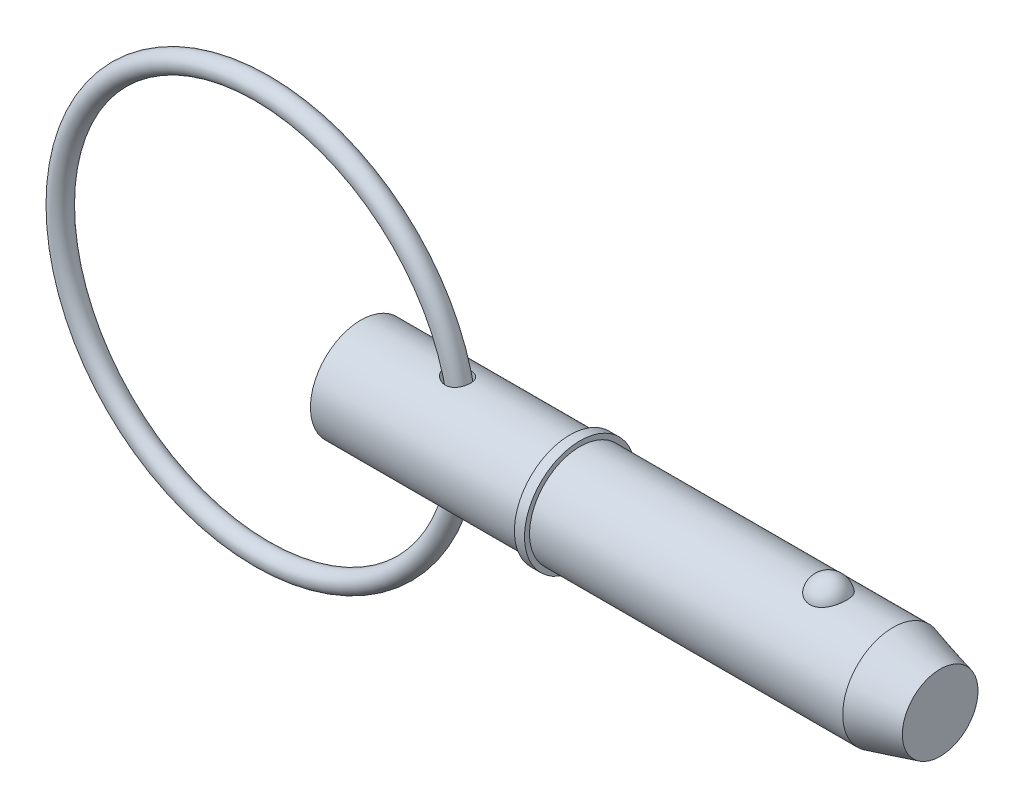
ISO-10303-21;
HEADER;
FILE_DESCRIPTION(('STEP AP214'),'2;1');
FILE_NAME('part.step','',(''),(''),'','','');
FILE_SCHEMA(('AUTOMOTIVE_DESIGN { 1 0 10303 214 1 1 1 1 }'));
ENDSEC;
DATA;
#1=APPLICATION_CONTEXT('core data for automotive mechanical design processes');
#2=APPLICATION_PROTOCOL_DEFINITION('international standard','automotive_design',2000,#1);
#3=PRODUCT_CONTEXT('',#1,'mechanical');
#4=PRODUCT('Part','Part','',(#3));
#5=PRODUCT_RELATED_PRODUCT_CATEGORY('part','',(#4));
#6=PRODUCT_DEFINITION_FORMATION('','',#4);
#7=PRODUCT_DEFINITION_CONTEXT('part definition',#1,'design');
#8=PRODUCT_DEFINITION('design','',#6,#7);
#9=PRODUCT_DEFINITION_SHAPE('','',#8);
#10=(LENGTH_UNIT() NAMED_UNIT(*) SI_UNIT(.MILLI.,.METRE.));
#11=(NAMED_UNIT(*) PLANE_ANGLE_UNIT() SI_UNIT($,.RADIAN.));
#12=(NAMED_UNIT(*) SI_UNIT($,.STERADIAN.) SOLID_ANGLE_UNIT());
#13=UNCERTAINTY_MEASURE_WITH_UNIT(LENGTH_MEASURE(1.E-05),#10,'distance_accuracy_value','');
#14=(GEOMETRIC_REPRESENTATION_CONTEXT(3) GLOBAL_UNCERTAINTY_ASSIGNED_CONTEXT((#13)) GLOBAL_UNIT_ASSIGNED_CONTEXT((#10,
#11,#12)) REPRESENTATION_CONTEXT('',''));
#15=CARTESIAN_POINT('',(0.,0.,0.));
#16=DIRECTION('',(0.,0.,1.));
#17=DIRECTION('',(1.,0.,0.));
#18=AXIS2_PLACEMENT_3D('',#15,#16,#17);
#19=CARTESIAN_POINT('',(-10.8860601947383,0.,0.));
#20=DIRECTION('',(0.,0.,1.));
#21=DIRECTION('',(1.,0.,0.));
#22=AXIS2_PLACEMENT_3D('',#19,#20,#21);
#23=TOROIDAL_SURFACE('',#22,22.225,1.111);
#24=CARTESIAN_POINT('',(12.4499398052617,0.,0.));
#25=VERTEX_POINT('',#24);
#26=VERTEX_LOOP('',#25);
#27=FACE_BOUND('',#26,.T.);
#28=ADVANCED_FACE('P0_F12',(#27),#23,.T.);
#29=CLOSED_SHELL('',(#28));
#30=MANIFOLD_SOLID_BREP('P0_B1',#29);
#31=CARTESIAN_POINT('',(0.,0.,0.));
#32=DIRECTION('',(1.,0.,0.));
#33=DIRECTION('',(0.,0.,-1.));
#34=AXIS2_PLACEMENT_3D('',#31,#32,#33);
#35=CYLINDRICAL_SURFACE('',#34,5.555);
#36=CARTESIAN_POINT('',(9.73108588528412,5.4531967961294,-1.05861687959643));
#37=CARTESIAN_POINT('',(9.79852417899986,5.4428857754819,-1.11173367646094));
#38=CARTESIAN_POINT('',(9.8705426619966,5.43287373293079,-1.15917228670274));
#39=CARTESIAN_POINT('',(10.0216706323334,5.41463354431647,-1.24159548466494));
#40=CARTESIAN_POINT('',(10.100788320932,5.40640749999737,-1.27656543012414));
#41=CARTESIAN_POINT('',(10.2640671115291,5.39277501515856,-1.33298568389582));
#42=CARTESIAN_POINT('',(10.3482338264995,5.38737178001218,-1.35442062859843));
#43=CARTESIAN_POINT('',(10.5191189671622,5.38018930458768,-1.38268153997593));
#44=CARTESIAN_POINT('',(10.6058357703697,5.37840780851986,-1.38951660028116));
#45=CARTESIAN_POINT('',(10.7759121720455,5.37883071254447,-1.38787777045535));
#46=CARTESIAN_POINT('',(10.8592768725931,5.38088957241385,-1.37996287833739));
#47=CARTESIAN_POINT('',(11.0231742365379,5.38856355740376,-1.34968531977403));
#48=CARTESIAN_POINT('',(11.1037078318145,5.39417750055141,-1.3273274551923));
#49=CARTESIAN_POINT('',(11.2542656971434,5.40784427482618,-1.27044672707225));
#50=CARTESIAN_POINT('',(11.3246325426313,5.41571997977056,-1.23678468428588));
#51=CARTESIAN_POINT('',(11.4584043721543,5.43310849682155,-1.15800564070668));
#52=CARTESIAN_POINT('',(11.5218100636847,5.4426211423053,-1.11288980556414));
#53=CARTESIAN_POINT('',(11.6387006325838,5.4619946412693,-1.01348173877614));
#54=CARTESIAN_POINT('',(11.6923567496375,5.47184490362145,-0.959388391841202));
#55=CARTESIAN_POINT('',(11.7899079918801,5.49098914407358,-0.842935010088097));
#56=CARTESIAN_POINT('',(11.8338027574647,5.50028310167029,-0.780574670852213));
#57=CARTESIAN_POINT('',(11.9111930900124,5.51740919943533,-0.64860577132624));
#58=CARTESIAN_POINT('',(11.944571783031,5.52522454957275,-0.578926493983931));
#59=CARTESIAN_POINT('',(11.9994972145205,5.53842713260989,-0.434834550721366));
#60=CARTESIAN_POINT('',(12.0210434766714,5.54381426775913,-0.360421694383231));
#61=CARTESIAN_POINT('',(12.0519313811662,5.55161917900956,-0.208311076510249));
#62=CARTESIAN_POINT('',(12.0611710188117,5.55401212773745,-0.130591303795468));
#63=CARTESIAN_POINT('',(12.0668974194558,5.55548938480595,0.0253480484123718));
#64=CARTESIAN_POINT('',(12.0633840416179,5.55457365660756,0.10356763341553));
#65=CARTESIAN_POINT('',(12.0436796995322,5.54953010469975,0.258343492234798));
#66=CARTESIAN_POINT('',(12.0274798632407,5.54540003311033,0.334898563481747));
#67=CARTESIAN_POINT('',(11.9827711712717,5.53437033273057,0.48411831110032));
#68=CARTESIAN_POINT('',(11.9542620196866,5.52747063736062,0.556782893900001));
#69=CARTESIAN_POINT('',(11.8856108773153,5.51165296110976,0.696153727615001));
#70=CARTESIAN_POINT('',(11.8454690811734,5.50273501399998,0.762860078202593));
#71=CARTESIAN_POINT('',(11.7545317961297,5.48386724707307,0.888403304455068));
#72=CARTESIAN_POINT('',(11.7037367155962,5.47391746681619,0.947240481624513));
#73=CARTESIAN_POINT('',(11.5931044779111,5.45416351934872,1.05504470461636));
#74=CARTESIAN_POINT('',(11.533318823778,5.44435885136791,1.10406448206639));
#75=CARTESIAN_POINT('',(11.4061321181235,5.42595363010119,1.19123649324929));
#76=CARTESIAN_POINT('',(11.3387321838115,5.41735290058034,1.22939031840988));
#77=CARTESIAN_POINT('',(11.1991395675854,5.4024225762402,1.29341737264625));
#78=CARTESIAN_POINT('',(11.1270175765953,5.39606585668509,1.3194385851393));
#79=CARTESIAN_POINT('',(10.979323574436,5.38614405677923,1.35937634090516));
#80=CARTESIAN_POINT('',(10.9037515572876,5.38257898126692,1.37329286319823));
#81=CARTESIAN_POINT('',(10.7507722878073,5.37854282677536,1.38901730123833));
#82=CARTESIAN_POINT('',(10.6733560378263,5.37809300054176,1.39074204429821));
#83=CARTESIAN_POINT('',(10.5192388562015,5.38029043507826,1.38221411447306));
#84=CARTESIAN_POINT('',(10.4425381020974,5.38293844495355,1.37195854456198));
#85=CARTESIAN_POINT('',(10.2878936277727,5.39116673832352,1.33926960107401));
#86=CARTESIAN_POINT('',(10.2100819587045,5.3968880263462,1.31624874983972));
#87=CARTESIAN_POINT('',(10.0591420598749,5.41064666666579,1.25849276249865));
#88=CARTESIAN_POINT('',(9.98601576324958,5.41868496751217,1.22375282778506));
#89=CARTESIAN_POINT('',(9.84175565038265,5.43675805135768,1.14087469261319));
#90=CARTESIAN_POINT('',(9.77103801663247,5.44688674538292,1.09202994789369));
#91=CARTESIAN_POINT('',(9.6388828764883,5.46759592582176,0.983100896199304));
#92=CARTESIAN_POINT('',(9.57744762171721,5.47817652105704,0.92301387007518));
#93=CARTESIAN_POINT('',(9.46620446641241,5.49850106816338,0.79298413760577));
#94=CARTESIAN_POINT('',(9.4163677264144,5.5082470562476,0.723066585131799));
#95=CARTESIAN_POINT('',(9.33050546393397,5.52566389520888,0.57497392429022));
#96=CARTESIAN_POINT('',(9.2944672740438,5.53333664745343,0.49680647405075));
#97=CARTESIAN_POINT('',(9.2410988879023,5.54491199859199,0.342579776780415));
#98=CARTESIAN_POINT('',(9.22228936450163,5.54910883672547,0.267055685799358));
#99=CARTESIAN_POINT('',(9.19883437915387,5.55436306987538,0.113748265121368));
#100=CARTESIAN_POINT('',(9.19417820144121,5.55542284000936,0.0359666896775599));
#101=CARTESIAN_POINT('',(9.19905385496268,5.55432298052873,-0.111477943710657));
#102=CARTESIAN_POINT('',(9.20724428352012,5.55246769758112,-0.181191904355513));
#103=CARTESIAN_POINT('',(9.23493000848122,5.54630180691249,-0.318223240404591));
#104=CARTESIAN_POINT('',(9.25442702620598,5.54199082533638,-0.385540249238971));
#105=CARTESIAN_POINT('',(9.30387481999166,5.5313474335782,-0.516280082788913));
#106=CARTESIAN_POINT('',(9.33386163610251,5.52500806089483,-0.579688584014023));
#107=CARTESIAN_POINT('',(9.40305503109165,5.51092599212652,-0.701037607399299));
#108=CARTESIAN_POINT('',(9.44225922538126,5.50318365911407,-0.758979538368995));
#109=CARTESIAN_POINT('',(9.52133732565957,5.48833949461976,-0.859230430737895));
#110=CARTESIAN_POINT('',(9.55998996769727,5.48134889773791,-0.90252975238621));
#111=CARTESIAN_POINT('',(9.64209346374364,5.46725903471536,-0.984288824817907));
#112=CARTESIAN_POINT('',(9.68554534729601,5.46015974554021,-1.02274753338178));
#113=CARTESIAN_POINT('',(9.73108588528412,5.4531967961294,-1.05861687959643));
#114=B_SPLINE_CURVE_WITH_KNOTS('',3,(#36,#37,#38,#39,#40,#41,#42,#43,#44,#45,#46,#47,#48,#49,
#50,#51,#52,#53,#54,#55,#56,#57,#58,#59,#60,#61,#62,#63,#64,#65,#66,#67,#68,#69,#70,#71,#72,#73,
#74,#75,#76,#77,#78,#79,#80,#81,#82,#83,#84,#85,#86,#87,#88,#89,#90,#91,#92,#93,#94,#95,#96,#97,
#98,#99,#100,#101,#102,#103,#104,#105,#106,#107,#108,#109,#110,#111,#112,#113),.UNSPECIFIED.,
.T.,.F.,(4,2,2,2,2,2,2,2,2,2,2,2,2,2,2,2,2,2,2,2,2,2,2,2,2,2,2,2,2,2,2,2,2,2,2,2,2,2,4),(0.,
0.259176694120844,0.518656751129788,0.778430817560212,1.03804303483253,1.28801585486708,
1.53790560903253,1.77195750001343,2.00598558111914,2.23539047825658,2.46480382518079,
2.69668356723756,2.9285726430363,3.16237203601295,3.39617401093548,3.63013963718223,
3.86411088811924,4.09807822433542,4.33203659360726,4.56470246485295,4.7973342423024,
5.02704913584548,5.25676442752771,5.48804534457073,5.71938220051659,5.96237360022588,
6.20546461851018,6.46387943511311,6.72235683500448,6.98018450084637,7.23777490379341,
7.47029684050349,7.70264268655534,7.91229396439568,8.12197716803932,8.33238797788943,
8.54274441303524,8.71772674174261,8.89274668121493),.UNSPECIFIED.);
#115=CARTESIAN_POINT('',(9.73108588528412,5.4531967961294,-1.05861687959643));
#116=VERTEX_POINT('',#115);
#117=EDGE_CURVE('P1_E42',#116,#116,#114,.T.);
#118=ORIENTED_EDGE('',*,*,#117,.T.);
#119=EDGE_LOOP('',(#118));
#120=FACE_BOUND('',#119,.T.);
#121=CARTESIAN_POINT('',(0.,0.,0.));
#122=DIRECTION('',(1.,0.,0.));
#123=DIRECTION('',(0.,0.,-1.));
#124=AXIS2_PLACEMENT_3D('',#121,#122,#123);
#125=CIRCLE('',#124,5.555);
#126=CARTESIAN_POINT('',(0.,0.,-5.555));
#127=VERTEX_POINT('',#126);
#128=EDGE_CURVE('P1_E9',#127,#127,#125,.T.);
#129=ORIENTED_EDGE('',*,*,#128,.T.);
#130=EDGE_LOOP('',(#129));
#131=FACE_BOUND('',#130,.T.);
#132=CARTESIAN_POINT('',(23.019,0.,0.));
#133=DIRECTION('',(1.,0.,0.));
#134=DIRECTION('',(0.,0.,-1.));
#135=AXIS2_PLACEMENT_3D('',#132,#133,#134);
#136=CIRCLE('',#135,5.555);
#137=CARTESIAN_POINT('',(23.019,0.,-5.555));
#138=VERTEX_POINT('',#137);
#139=EDGE_CURVE('P1_E25',#138,#138,#136,.T.);
#140=ORIENTED_EDGE('',*,*,#139,.F.);
#141=EDGE_LOOP('',(#140));
#142=FACE_BOUND('',#141,.T.);
#143=CARTESIAN_POINT('',(9.73108588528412,-5.4531967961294,-1.05861687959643));
#144=CARTESIAN_POINT('',(9.66821110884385,-5.46281068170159,-1.00909184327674));
#145=CARTESIAN_POINT('',(9.60927221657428,-5.47269103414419,-0.954597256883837));
#146=CARTESIAN_POINT('',(9.50103698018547,-5.49196271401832,-0.836622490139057));
#147=CARTESIAN_POINT('',(9.45174193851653,-5.50135397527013,-0.77314109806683));
#148=CARTESIAN_POINT('',(9.36449982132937,-5.51864538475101,-0.638139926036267));
#149=CARTESIAN_POINT('',(9.32660692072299,-5.52653835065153,-0.566583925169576));
#150=CARTESIAN_POINT('',(9.26443740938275,-5.53978685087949,-0.417563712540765));
#151=CARTESIAN_POINT('',(9.24015003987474,-5.54514438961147,-0.34010422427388));
#152=CARTESIAN_POINT('',(9.20806696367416,-5.55228040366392,-0.18838925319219));
#153=CARTESIAN_POINT('',(9.19907227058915,-5.55431849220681,-0.114399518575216));
#154=CARTESIAN_POINT('',(9.19432225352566,-5.55539069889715,0.0340148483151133));
#155=CARTESIAN_POINT('',(9.19856204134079,-5.55442592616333,0.108439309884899));
#156=CARTESIAN_POINT('',(9.21926816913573,-5.54978420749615,0.250226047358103));
#157=CARTESIAN_POINT('',(9.2348766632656,-5.54629766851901,0.31772275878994));
#158=CARTESIAN_POINT('',(9.27656619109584,-5.53719805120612,0.449233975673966));
#159=CARTESIAN_POINT('',(9.3026486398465,-5.53158468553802,0.513248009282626));
#160=CARTESIAN_POINT('',(9.36540111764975,-5.51852259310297,0.63880901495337));
#161=CARTESIAN_POINT('',(9.40244578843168,-5.51101059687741,0.700161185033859));
#162=CARTESIAN_POINT('',(9.48531033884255,-5.49498546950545,0.816463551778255));
#163=CARTESIAN_POINT('',(9.5311337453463,-5.48647193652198,0.871411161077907));
#164=CARTESIAN_POINT('',(9.63549825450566,-5.46826315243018,0.979510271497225));
#165=CARTESIAN_POINT('',(9.69487291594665,-5.4585383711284,1.03185240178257));
#166=CARTESIAN_POINT('',(9.82107706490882,-5.43973797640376,1.12677509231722));
#167=CARTESIAN_POINT('',(9.8879103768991,-5.43066269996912,1.16935061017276));
#168=CARTESIAN_POINT('',(10.033391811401,-5.41336505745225,1.24708757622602));
#169=CARTESIAN_POINT('',(10.1125613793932,-5.40528106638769,1.28130933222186));
#170=CARTESIAN_POINT('',(10.2757060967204,-5.39196874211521,1.3362270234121));
#171=CARTESIAN_POINT('',(10.3596813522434,-5.38674047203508,1.35692265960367));
#172=CARTESIAN_POINT('',(10.5297702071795,-5.37991196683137,1.38375156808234));
#173=CARTESIAN_POINT('',(10.6158742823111,-5.37829778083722,1.38994084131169));
#174=CARTESIAN_POINT('',(10.7878226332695,-5.3790107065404,1.38718250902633));
#175=CARTESIAN_POINT('',(10.8736670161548,-5.38133587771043,1.37824235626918));
#176=CARTESIAN_POINT('',(11.0366214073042,-5.38945418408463,1.34612618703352));
#177=CARTESIAN_POINT('',(11.1139351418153,-5.39501006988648,1.32392147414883));
#178=CARTESIAN_POINT('',(11.2633246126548,-5.40877222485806,1.26652021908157));
#179=CARTESIAN_POINT('',(11.3354015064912,-5.4169779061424,1.23132655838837));
#180=CARTESIAN_POINT('',(11.4690899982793,-5.43466078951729,1.15069817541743));
#181=CARTESIAN_POINT('',(11.5310200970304,-5.4440673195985,1.10577441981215));
#182=CARTESIAN_POINT('',(11.6463540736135,-5.46335537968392,1.0061512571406));
#183=CARTESIAN_POINT('',(11.6997580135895,-5.47323690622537,0.951451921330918));
#184=CARTESIAN_POINT('',(11.7967319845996,-5.49239864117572,0.833747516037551));
#185=CARTESIAN_POINT('',(11.8402908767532,-5.50167816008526,0.770733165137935));
#186=CARTESIAN_POINT('',(11.9164538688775,-5.518621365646,0.638202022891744));
#187=CARTESIAN_POINT('',(11.9490573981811,-5.52628496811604,0.568684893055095));
#188=CARTESIAN_POINT('',(12.0028717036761,-5.53925911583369,0.424207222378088));
#189=CARTESIAN_POINT('',(12.023941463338,-5.54454040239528,0.349191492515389));
#190=CARTESIAN_POINT('',(12.053591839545,-5.55204602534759,0.196582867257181));
#191=CARTESIAN_POINT('',(12.0621722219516,-5.55427030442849,0.118989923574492));
#192=CARTESIAN_POINT('',(12.0666512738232,-5.55542602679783,-0.0368468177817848));
#193=CARTESIAN_POINT('',(12.0625074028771,-5.55434642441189,-0.115091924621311));
#194=CARTESIAN_POINT('',(12.0415418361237,-5.54898613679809,-0.269753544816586));
#195=CARTESIAN_POINT('',(12.0247199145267,-5.54470539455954,-0.346170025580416));
#196=CARTESIAN_POINT('',(11.9787920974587,-5.53340452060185,-0.495008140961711));
#197=CARTESIAN_POINT('',(11.9496857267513,-5.52638428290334,-0.56742962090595));
#198=CARTESIAN_POINT('',(11.8798787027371,-5.51036911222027,-0.706216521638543));
#199=CARTESIAN_POINT('',(11.8391779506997,-5.50137416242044,-0.772581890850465));
#200=CARTESIAN_POINT('',(11.7472553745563,-5.48242167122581,-0.89724716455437));
#201=CARTESIAN_POINT('',(11.6960515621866,-5.47246579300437,-0.955560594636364));
#202=CARTESIAN_POINT('',(11.5843994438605,-5.45270071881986,-1.06256643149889));
#203=CARTESIAN_POINT('',(11.5239521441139,-5.44289150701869,-1.11125988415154));
#204=CARTESIAN_POINT('',(11.396157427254,-5.42463941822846,-1.19717500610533));
#205=CARTESIAN_POINT('',(11.3288903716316,-5.41618309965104,-1.23451335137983));
#206=CARTESIAN_POINT('',(11.1888557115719,-5.40145691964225,-1.29743539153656));
#207=CARTESIAN_POINT('',(11.1160887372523,-5.39518680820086,-1.32302043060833));
#208=CARTESIAN_POINT('',(10.9677009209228,-5.38553131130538,-1.36179181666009));
#209=CARTESIAN_POINT('',(10.8921036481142,-5.3821260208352,-1.3750637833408));
#210=CARTESIAN_POINT('',(10.7396925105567,-5.37842027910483,-1.38948741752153));
#211=CARTESIAN_POINT('',(10.6628784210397,-5.37812040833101,-1.39063681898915));
#212=CARTESIAN_POINT('',(10.5077947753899,-5.38059635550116,-1.38102577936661));
#213=CARTESIAN_POINT('',(10.4295489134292,-5.3834629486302,-1.36991384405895));
#214=CARTESIAN_POINT('',(10.2758428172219,-5.3920092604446,-1.33587599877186));
#215=CARTESIAN_POINT('',(10.2003829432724,-5.39768934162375,-1.3129485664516));
#216=CARTESIAN_POINT('',(10.0559381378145,-5.41102817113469,-1.25682313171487));
#217=CARTESIAN_POINT('',(9.98683368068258,-5.41862962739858,-1.22391777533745));
#218=CARTESIAN_POINT('',(9.85432617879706,-5.43513913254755,-1.14838146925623));
#219=CARTESIAN_POINT('',(9.79092361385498,-5.44404729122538,-1.1057497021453));
#220=CARTESIAN_POINT('',(9.73108588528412,-5.4531967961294,-1.05861687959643));
#221=B_SPLINE_CURVE_WITH_KNOTS('',3,(#143,#144,#145,#146,#147,#148,#149,#150,#151,#152,#153,
#154,#155,#156,#157,#158,#159,#160,#161,#162,#163,#164,#165,#166,#167,#168,#169,#170,#171,#172,
#173,#174,#175,#176,#177,#178,#179,#180,#181,#182,#183,#184,#185,#186,#187,#188,#189,#190,#191,
#192,#193,#194,#195,#196,#197,#198,#199,#200,#201,#202,#203,#204,#205,#206,#207,#208,#209,#210,
#211,#212,#213,#214,#215,#216,#217,#218,#219,#220),.UNSPECIFIED.,.T.,.F.,(4,2,2,2,2,2,2,2,2,2,2,
2,2,2,2,2,2,2,2,2,2,2,2,2,2,2,2,2,2,2,2,2,2,2,2,2,2,2,4),(0.,0.241596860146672,
0.483226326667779,0.725986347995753,0.968554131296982,1.19103755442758,1.41343881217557,
1.62059806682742,1.82778531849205,2.04308674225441,2.25847484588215,2.4967195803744,
2.73508704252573,2.99374644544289,3.25241156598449,3.51007646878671,3.76761448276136,
4.00827541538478,4.24888299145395,4.47904430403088,4.70920393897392,4.93962269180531,
5.17005344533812,5.4032419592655,5.63643484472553,5.87040820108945,6.10438572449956,
6.33837230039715,6.57236086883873,6.80595147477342,7.03951667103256,7.27059385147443,
7.50164459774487,7.73107640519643,7.96055109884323,8.19677907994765,8.43303750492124,
8.66294515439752,8.8928721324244),.UNSPECIFIED.);
#222=CARTESIAN_POINT('',(9.73108588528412,-5.4531967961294,-1.05861687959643));
#223=VERTEX_POINT('',#222);
#224=EDGE_CURVE('P1_E17',#223,#223,#221,.T.);
#225=ORIENTED_EDGE('',*,*,#224,.T.);
#226=EDGE_LOOP('',(#225));
#227=FACE_BOUND('',#226,.T.);
#228=ADVANCED_FACE('P1_F13',(#120,#131,#142,#227),#35,.T.);
#229=CARTESIAN_POINT('',(0.,0.,0.));
#230=DIRECTION('',(1.,0.,0.));
#231=DIRECTION('',(0.,0.,-1.));
#232=AXIS2_PLACEMENT_3D('',#229,#230,#231);
#233=CYLINDRICAL_SURFACE('',#232,5.555);
#234=CARTESIAN_POINT('',(58.6171144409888,0.,0.));
#235=DIRECTION('',(1.,0.,0.));
#236=DIRECTION('',(0.,0.,-1.));
#237=AXIS2_PLACEMENT_3D('',#234,#235,#236);
#238=CIRCLE('',#237,5.555);
#239=CARTESIAN_POINT('',(58.6171144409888,0.,-5.555));
#240=VERTEX_POINT('',#239);
#241=EDGE_CURVE('P1_E99',#240,#240,#238,.T.);
#242=ORIENTED_EDGE('',*,*,#241,.F.);
#243=EDGE_LOOP('',(#242));
#244=FACE_BOUND('',#243,.T.);
#245=CARTESIAN_POINT('',(24.13,0.,0.));
#246=DIRECTION('',(1.,0.,0.));
#247=DIRECTION('',(0.,0.,-1.));
#248=AXIS2_PLACEMENT_3D('',#245,#246,#247);
#249=CIRCLE('',#248,5.555);
#250=CARTESIAN_POINT('',(24.13,0.,-5.555));
#251=VERTEX_POINT('',#250);
#252=EDGE_CURVE('P1_E96',#251,#251,#249,.T.);
#253=ORIENTED_EDGE('',*,*,#252,.T.);
#254=EDGE_LOOP('',(#253));
#255=FACE_BOUND('',#254,.T.);
#256=CARTESIAN_POINT('',(51.4986264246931,5.16741224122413,2.03859650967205));
#257=CARTESIAN_POINT('',(51.3929492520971,5.16740893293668,2.03859990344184));
#258=CARTESIAN_POINT('',(51.2872989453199,5.17079470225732,2.03008306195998));
#259=CARTESIAN_POINT('',(51.0791419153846,5.18392795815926,1.9963072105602));
#260=CARTESIAN_POINT('',(50.9766344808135,5.19367399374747,1.9710520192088));
#261=CARTESIAN_POINT('',(50.7777710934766,5.21839168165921,1.90463997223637));
#262=CARTESIAN_POINT('',(50.6814064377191,5.23335573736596,1.86350622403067));
#263=CARTESIAN_POINT('',(50.4970804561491,5.26688076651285,1.76652592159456));
#264=CARTESIAN_POINT('',(50.4091207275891,5.28544242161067,1.71067657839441));
#265=CARTESIAN_POINT('',(50.241265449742,5.32479845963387,1.58399959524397));
#266=CARTESIAN_POINT('',(50.1616656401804,5.34564089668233,1.51279545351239));
#267=CARTESIAN_POINT('',(50.0151290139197,5.38697258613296,1.35828584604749));
#268=CARTESIAN_POINT('',(49.948194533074,5.40746177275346,1.27497815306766));
#269=CARTESIAN_POINT('',(49.8256103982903,5.44694508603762,1.09440293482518));
#270=CARTESIAN_POINT('',(49.7705989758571,5.46583143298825,0.99667783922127));
#271=CARTESIAN_POINT('',(49.6769376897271,5.49908030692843,0.792961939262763));
#272=CARTESIAN_POINT('',(49.6382894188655,5.513442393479,0.686970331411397));
#273=CARTESIAN_POINT('',(49.5776807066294,5.536358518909,0.468019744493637));
#274=CARTESIAN_POINT('',(49.5559725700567,5.54482455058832,0.35498154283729));
#275=CARTESIAN_POINT('',(49.5306362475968,5.55473324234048,0.126595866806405));
#276=CARTESIAN_POINT('',(49.5270077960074,5.55617600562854,0.0112484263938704));
#277=CARTESIAN_POINT('',(49.5378817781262,5.55189984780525,-0.21801161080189));
#278=CARTESIAN_POINT('',(49.5523151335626,5.54620821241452,-0.331928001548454));
#279=CARTESIAN_POINT('',(49.598903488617,5.52828920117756,-0.555544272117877));
#280=CARTESIAN_POINT('',(49.6310588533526,5.5160616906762,-0.665244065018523));
#281=CARTESIAN_POINT('',(49.7124883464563,5.48630779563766,-0.877469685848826));
#282=CARTESIAN_POINT('',(49.7617816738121,5.4687754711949,-0.979987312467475));
#283=CARTESIAN_POINT('',(49.8764785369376,5.43024700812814,-1.1748697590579));
#284=CARTESIAN_POINT('',(49.9418831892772,5.4092506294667,-1.26723387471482));
#285=CARTESIAN_POINT('',(50.0875712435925,5.36600927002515,-1.4394013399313));
#286=CARTESIAN_POINT('',(50.1678859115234,5.34376173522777,-1.51917763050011));
#287=CARTESIAN_POINT('',(50.3414520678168,5.30057971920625,-1.6636033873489));
#288=CARTESIAN_POINT('',(50.434702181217,5.27964509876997,-1.72825445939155));
#289=CARTESIAN_POINT('',(50.6293939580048,5.24205250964,-1.8390947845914));
#290=CARTESIAN_POINT('',(50.7305900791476,5.22530519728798,-1.88568407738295));
#291=CARTESIAN_POINT('',(50.9401552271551,5.19750919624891,-1.96100802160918));
#292=CARTESIAN_POINT('',(51.0485215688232,5.1864583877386,-1.98974931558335));
#293=CARTESIAN_POINT('',(51.2634989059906,5.17184410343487,-2.02742262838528));
#294=CARTESIAN_POINT('',(51.369925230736,5.16793282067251,-2.0372760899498));
#295=CARTESIAN_POINT('',(51.5829925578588,5.1669899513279,-2.03966777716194));
#296=CARTESIAN_POINT('',(51.6896335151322,5.16995704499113,-2.03220932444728));
#297=CARTESIAN_POINT('',(51.8967730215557,5.18222383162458,-2.0007117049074));
#298=CARTESIAN_POINT('',(51.9973599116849,5.19133213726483,-1.97717337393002));
#299=CARTESIAN_POINT('',(52.1930141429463,5.21467637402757,-1.91475248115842));
#300=CARTESIAN_POINT('',(52.2880810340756,5.22891272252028,-1.87586867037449));
#301=CARTESIAN_POINT('',(52.4723711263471,5.26137066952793,-1.78282713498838));
#302=CARTESIAN_POINT('',(52.5614190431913,5.27967329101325,-1.7283512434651));
#303=CARTESIAN_POINT('',(52.7292880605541,5.31817411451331,-1.60597483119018));
#304=CARTESIAN_POINT('',(52.8081068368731,5.33837274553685,-1.53807126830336));
#305=CARTESIAN_POINT('',(52.9575156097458,5.37968287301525,-1.38688970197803));
#306=CARTESIAN_POINT('',(53.0275058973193,5.40079011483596,-1.30301744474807));
#307=CARTESIAN_POINT('',(53.1530125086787,5.44074401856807,-1.12458170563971));
#308=CARTESIAN_POINT('',(53.2085262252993,5.4595902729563,-1.03001630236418));
#309=CARTESIAN_POINT('',(53.3055507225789,5.49369849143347,-0.829439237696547));
#310=CARTESIAN_POINT('',(53.3465483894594,5.50882422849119,-0.723155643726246));
#311=CARTESIAN_POINT('',(53.4111250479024,5.53310911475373,-0.50477271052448));
#312=CARTESIAN_POINT('',(53.4347036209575,5.54226812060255,-0.3926732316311));
#313=CARTESIAN_POINT('',(53.464013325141,5.55370358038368,-0.165459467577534));
#314=CARTESIAN_POINT('',(53.4696884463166,5.55595843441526,-0.0503368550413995));
#315=CARTESIAN_POINT('',(53.462916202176,5.55329317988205,0.179288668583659));
#316=CARTESIAN_POINT('',(53.4504690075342,5.54837313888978,0.293791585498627));
#317=CARTESIAN_POINT('',(53.4077798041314,5.53189037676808,0.518526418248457));
#318=CARTESIAN_POINT('',(53.377598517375,5.5203503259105,0.628771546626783));
#319=CARTESIAN_POINT('',(53.3000962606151,5.49182453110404,0.842318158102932));
#320=CARTESIAN_POINT('',(53.2527743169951,5.47483847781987,0.945619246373));
#321=CARTESIAN_POINT('',(53.1417204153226,5.43710633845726,1.14281571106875));
#322=CARTESIAN_POINT('',(53.0779215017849,5.41634501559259,1.23667048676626));
#323=CARTESIAN_POINT('',(52.9353577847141,5.37334572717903,1.4118524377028));
#324=CARTESIAN_POINT('',(52.8565932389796,5.35110778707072,1.49317982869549));
#325=CARTESIAN_POINT('',(52.6864234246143,5.30779474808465,1.64049162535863));
#326=CARTESIAN_POINT('',(52.5951002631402,5.28671324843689,1.7065687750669));
#327=CARTESIAN_POINT('',(52.4017390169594,5.24804852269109,1.82201372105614));
#328=CARTESIAN_POINT('',(52.2997005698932,5.23046541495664,1.87138095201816));
#329=CARTESIAN_POINT('',(52.0836187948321,5.20042692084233,1.95335298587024));
#330=CARTESIAN_POINT('',(51.969260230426,5.18820192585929,1.98521734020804));
#331=CARTESIAN_POINT('',(51.7361307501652,5.17169804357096,2.02783294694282));
#332=CARTESIAN_POINT('',(51.6173616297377,5.16741595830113,2.03859269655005));
#333=CARTESIAN_POINT('',(51.4986264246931,5.16741224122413,2.03859650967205));
#334=B_SPLINE_CURVE_WITH_KNOTS('',3,(#256,#257,#258,#259,#260,#261,#262,#263,#264,#265,#266,
#267,#268,#269,#270,#271,#272,#273,#274,#275,#276,#277,#278,#279,#280,#281,#282,#283,#284,#285,
#286,#287,#288,#289,#290,#291,#292,#293,#294,#295,#296,#297,#298,#299,#300,#301,#302,#303,#304,
#305,#306,#307,#308,#309,#310,#311,#312,#313,#314,#315,#316,#317,#318,#319,#320,#321,#322,#323,
#324,#325,#326,#327,#328,#329,#330,#331,#332,#333),.UNSPECIFIED.,.T.,.F.,(4,2,2,2,2,2,2,2,2,2,2,
2,2,2,2,2,2,2,2,2,2,2,2,2,2,2,2,2,2,2,2,2,2,2,2,2,2,2,4),(0.,0.316595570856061,
0.633118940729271,0.949183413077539,1.26530783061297,1.59030762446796,1.91536729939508,
2.25495824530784,2.59458224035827,2.93917283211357,3.28375835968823,3.62703002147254,
3.97030875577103,4.31397329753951,4.65766166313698,5.00207904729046,5.34645984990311,
5.6827054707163,6.01882587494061,6.33808403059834,6.65728093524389,6.9669637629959,
7.27667180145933,7.59321535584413,7.90983070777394,8.24210387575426,8.57443684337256,
8.91755896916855,9.26068933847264,9.60489211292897,9.94909164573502,10.2921194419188,
10.6351667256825,10.9796305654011,11.324088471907,11.666392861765,12.0087088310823,
12.3645679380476,12.7202837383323),.UNSPECIFIED.);
#335=CARTESIAN_POINT('',(51.4986264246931,5.16741224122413,2.03859650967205));
#336=VERTEX_POINT('',#335);
#337=EDGE_CURVE('P1_E34',#336,#336,#334,.T.);
#338=ORIENTED_EDGE('',*,*,#337,.T.);
#339=EDGE_LOOP('',(#338));
#340=FACE_BOUND('',#339,.T.);
#341=ADVANCED_FACE('P1_F46',(#244,#255,#340),#233,.T.);
#342=CARTESIAN_POINT('',(0.,0.,0.));
#343=DIRECTION('',(-1.,0.,0.));
#344=DIRECTION('',(0.,0.,1.));
#345=AXIS2_PLACEMENT_3D('',#342,#343,#344);
#346=PLANE('',#345);
#347=ORIENTED_EDGE('',*,*,#128,.F.);
#348=EDGE_LOOP('',(#347));
#349=FACE_BOUND('',#348,.T.);
#350=ADVANCED_FACE('P1_F15',(#349),#346,.T.);
#351=CARTESIAN_POINT('',(23.019,5.555,0.));
#352=DIRECTION('',(-1.,0.,0.));
#353=DIRECTION('',(0.,0.,1.));
#354=AXIS2_PLACEMENT_3D('',#351,#352,#353);
#355=PLANE('',#354);
#356=ORIENTED_EDGE('',*,*,#139,.T.);
#357=EDGE_LOOP('',(#356));
#358=FACE_BOUND('',#357,.T.);
#359=CARTESIAN_POINT('',(23.019,0.,0.));
#360=DIRECTION('',(1.,0.,0.));
#361=DIRECTION('',(0.,0.,-1.));
#362=AXIS2_PLACEMENT_3D('',#359,#360,#361);
#363=CIRCLE('',#362,6.1105);
#364=CARTESIAN_POINT('',(23.019,0.,-6.1105));
#365=VERTEX_POINT('',#364);
#366=EDGE_CURVE('P1_E30',#365,#365,#363,.T.);
#367=ORIENTED_EDGE('',*,*,#366,.F.);
#368=EDGE_LOOP('',(#367));
#369=FACE_BOUND('',#368,.T.);
#370=ADVANCED_FACE('P1_F81',(#358,#369),#355,.T.);
#371=CARTESIAN_POINT('',(0.,0.,0.));
#372=DIRECTION('',(1.,0.,0.));
#373=DIRECTION('',(0.,0.,-1.));
#374=AXIS2_PLACEMENT_3D('',#371,#372,#373);
#375=CYLINDRICAL_SURFACE('',#374,6.1105);
#376=ORIENTED_EDGE('',*,*,#366,.T.);
#377=EDGE_LOOP('',(#376));
#378=FACE_BOUND('',#377,.T.);
#379=CARTESIAN_POINT('',(24.13,0.,0.));
#380=DIRECTION('',(1.,0.,0.));
#381=DIRECTION('',(0.,0.,-1.));
#382=AXIS2_PLACEMENT_3D('',#379,#380,#381);
#383=CIRCLE('',#382,6.1105);
#384=CARTESIAN_POINT('',(24.13,0.,-6.1105));
#385=VERTEX_POINT('',#384);
#386=EDGE_CURVE('P1_E95',#385,#385,#383,.T.);
#387=ORIENTED_EDGE('',*,*,#386,.F.);
#388=EDGE_LOOP('',(#387));
#389=FACE_BOUND('',#388,.T.);
#390=ADVANCED_FACE('P1_F68',(#378,#389),#375,.T.);
#391=CARTESIAN_POINT('',(24.13,6.1105,0.));
#392=DIRECTION('',(1.,0.,0.));
#393=DIRECTION('',(0.,0.,-1.));
#394=AXIS2_PLACEMENT_3D('',#391,#392,#393);
#395=PLANE('',#394);
#396=ORIENTED_EDGE('',*,*,#386,.T.);
#397=EDGE_LOOP('',(#396));
#398=FACE_BOUND('',#397,.T.);
#399=ORIENTED_EDGE('',*,*,#252,.F.);
#400=EDGE_LOOP('',(#399));
#401=FACE_BOUND('',#400,.T.);
#402=ADVANCED_FACE('P1_F62',(#398,#401),#395,.T.);
#403=CARTESIAN_POINT('',(63.8,0.,0.));
#404=DIRECTION('',(-1.,0.,0.));
#405=DIRECTION('',(0.,0.,1.));
#406=AXIS2_PLACEMENT_3D('',#403,#404,#405);
#407=CONICAL_SURFACE('',#406,4.16625000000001,0.261799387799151);
#408=ORIENTED_EDGE('',*,*,#241,.T.);
#409=EDGE_LOOP('',(#408));
#410=FACE_BOUND('',#409,.T.);
#411=CARTESIAN_POINT('',(63.8,0.,0.));
#412=DIRECTION('',(1.,0.,0.));
#413=DIRECTION('',(0.,0.,-1.));
#414=AXIS2_PLACEMENT_3D('',#411,#412,#413);
#415=CIRCLE('',#414,4.16625000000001);
#416=CARTESIAN_POINT('',(63.8,0.,-4.16625000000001));
#417=VERTEX_POINT('',#416);
#418=EDGE_CURVE('P1_E41',#417,#417,#415,.T.);
#419=ORIENTED_EDGE('',*,*,#418,.F.);
#420=EDGE_LOOP('',(#419));
#421=FACE_BOUND('',#420,.T.);
#422=ADVANCED_FACE('P1_F59',(#410,#421),#407,.T.);
#423=CARTESIAN_POINT('',(63.8,4.16625000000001,0.));
#424=DIRECTION('',(1.,0.,0.));
#425=DIRECTION('',(0.,0.,-1.));
#426=AXIS2_PLACEMENT_3D('',#423,#424,#425);
#427=PLANE('',#426);
#428=ORIENTED_EDGE('',*,*,#418,.T.);
#429=EDGE_LOOP('',(#428));
#430=FACE_BOUND('',#429,.T.);
#431=ADVANCED_FACE('P1_F55',(#430),#427,.T.);
#432=CARTESIAN_POINT('',(51.4986264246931,4.9995,0.));
#433=DIRECTION('',(-1.,0.,0.));
#434=DIRECTION('',(0.,1.,0.));
#435=AXIS2_PLACEMENT_3D('',#432,#433,#434);
#436=SPHERICAL_SURFACE('',#435,2.04549999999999);
#437=ORIENTED_EDGE('',*,*,#337,.F.);
#438=EDGE_LOOP('',(#437));
#439=FACE_BOUND('',#438,.T.);
#440=ADVANCED_FACE('P1_F50',(#439),#436,.T.);
#441=CARTESIAN_POINT('',(-10.8860601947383,0.,0.));
#442=DIRECTION('',(0.,0.,1.));
#443=DIRECTION('',(1.,0.,0.));
#444=AXIS2_PLACEMENT_3D('',#441,#442,#443);
#445=TOROIDAL_SURFACE('',#444,22.225,1.38875);
#446=ORIENTED_EDGE('',*,*,#224,.F.);
#447=EDGE_LOOP('',(#446));
#448=FACE_BOUND('',#447,.T.);
#449=ORIENTED_EDGE('',*,*,#117,.F.);
#450=EDGE_LOOP('',(#449));
#451=FACE_BOUND('',#450,.T.);
#452=ADVANCED_FACE('P1_F54',(#448,#451),#445,.F.);
#453=CLOSED_SHELL('',(#228,#341,#350,#370,#390,#402,#422,#431,#440,#452));
#454=MANIFOLD_SOLID_BREP('P1_B1',#453);
#455=ADVANCED_BREP_SHAPE_REPRESENTATION('',(#18,#30,#454),#14);
#456=SHAPE_DEFINITION_REPRESENTATION(#9,#455);
ENDSEC;
END-ISO-10303-21;
